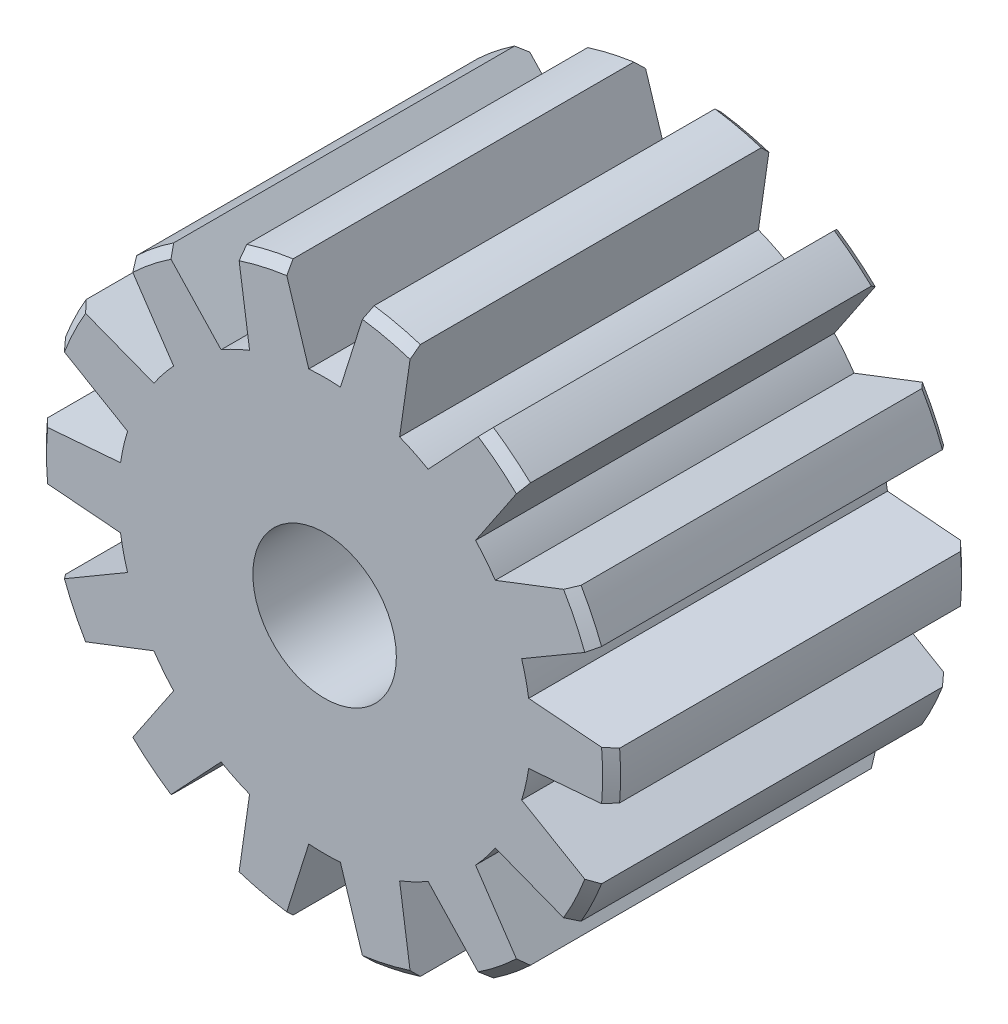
from build123d import *

# Parameters (mm, degrees)
ESQUISSE2_R             = 4
DIAM_TRE_DE_T_TE_DEPTH  = 2.5
CHANFREINS_SIZE         = 0.125
CREUX_DENT_DEPTH        = 7.184658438
CREUX_DENT_DEPTH_BACK   = 7.184658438
R_P_TITION_COUNT        = 14
ESQUISSE4_R             = 1
ENL_V_MAT_EXTRU_1_DEPTH = 8.528658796


with BuildPart() as part:
    # Esquisse2 → Diam_tre de t_te (new, symmetric)
    with BuildSketch(Plane.XY):
        Circle(ESQUISSE2_R)
    extrude(amount=DIAM_TRE_DE_T_TE_DEPTH, both=True)

    # Chanfreins
    chanfreins_edges = [part.edges().sort_by_distance(p)[0] for p in [
        (-4, 0, -2.5),
        (-4, 0, 2.5),
    ]]
    chamfer(chanfreins_edges, length=CHANFREINS_SIZE)

    # Esquisse3 → Creux dent (cut, two sides: drawn at the far end of the back side and taken through both)
    with BuildSketch(Plane.XY.offset(-CREUX_DENT_DEPTH_BACK)):
        with BuildLine():
            Line((-0.220334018, 2.866544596), (-0.565063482, 3.959886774))
            ThreePointArc((-0.565063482, 3.959886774), (0, 4), (0.565063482, 3.959886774))
            Line((0.565063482, 3.959886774), (0.220334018, 2.866544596))
            ThreePointArc((0.220334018, 2.866544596), (0, 2.875), (-0.220334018, 2.866544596))
        make_face()
    creux_dent = extrude(amount=CREUX_DENT_DEPTH + CREUX_DENT_DEPTH_BACK, mode=Mode.SUBTRACT)

    # R_p_tition: Creux dent ×14 about axis
    r_p_tition_axis = Axis((0, 0, 0), (0, 0, 1))
    for i in range(1, R_P_TITION_COUNT):
        add(creux_dent.rotate(r_p_tition_axis, i * 360 / R_P_TITION_COUNT), mode=Mode.SUBTRACT)

    # Esquisse4 → Enl_v. mat.-Extru.1 (cut, through all)
    with BuildSketch(Plane.XY.offset(2.5)):
        Circle(ESQUISSE4_R)
    extrude(amount=-ENL_V_MAT_EXTRU_1_DEPTH, mode=Mode.SUBTRACT)


solid = part.part
